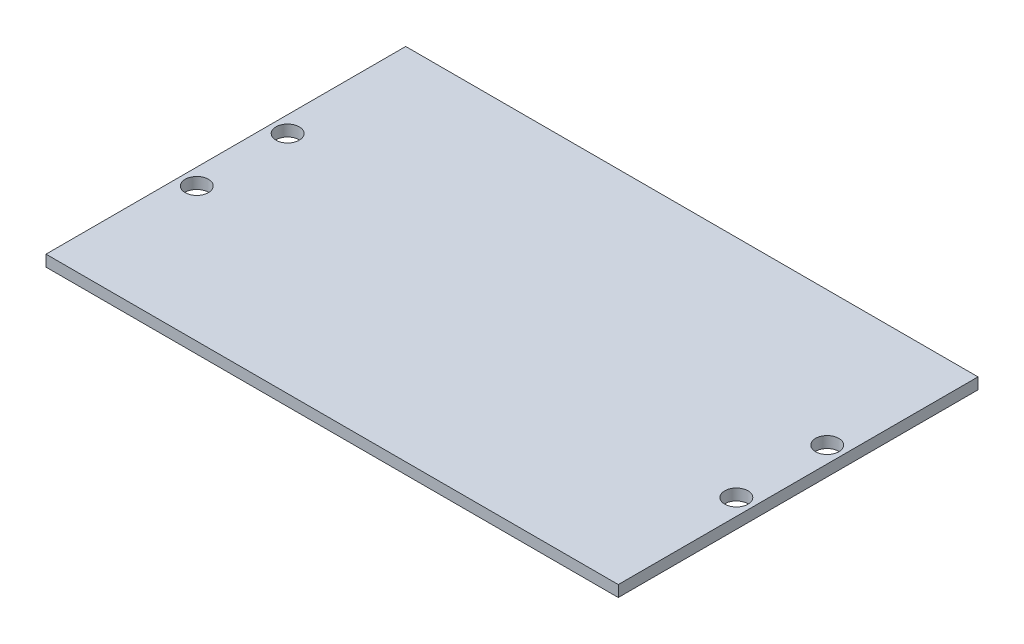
from build123d import *

# Parameters (mm, degrees)
SKETCH1_W           = 80.01
SKETCH1_H           = 50.292
BOSS_EXTRUDE1_DEPTH = 1.5748
SKETCH2_R           = 1.6256
CUT_EXTRUDE1_DEPTH  = 1.5748


with BuildPart() as part:
    # Sketch1 → Boss-Extrude1 (new body)
    with BuildSketch(Plane(origin=(0, 0, 0), x_dir=(1, 0, 0), z_dir=(0, 1, 0))):
        Rectangle(SKETCH1_W, SKETCH1_H)
    extrude(amount=BOSS_EXTRUDE1_DEPTH)

    # Sketch2 → Cut-Extrude1 (cut)
    with BuildSketch(Plane(origin=(0, 1.5748, 0), x_dir=(1, 0, 0), z_dir=(0, 1, 0))):
        with Locations(Location((-37.719, 6.35, 0), (0, 0, 270))):
            Circle(SKETCH2_R)
        with Locations(Location((-37.719, -6.35, 0), (0, 0, 270))):
            Circle(SKETCH2_R)
        with Locations(Location((37.719, 6.35, 0), (0, 0, 270))):
            Circle(SKETCH2_R)
        with Locations(Location((37.719, -6.35, 0), (0, 0, 270))):
            Circle(SKETCH2_R)
    extrude(amount=-CUT_EXTRUDE1_DEPTH, mode=Mode.SUBTRACT)


solid = part.part
